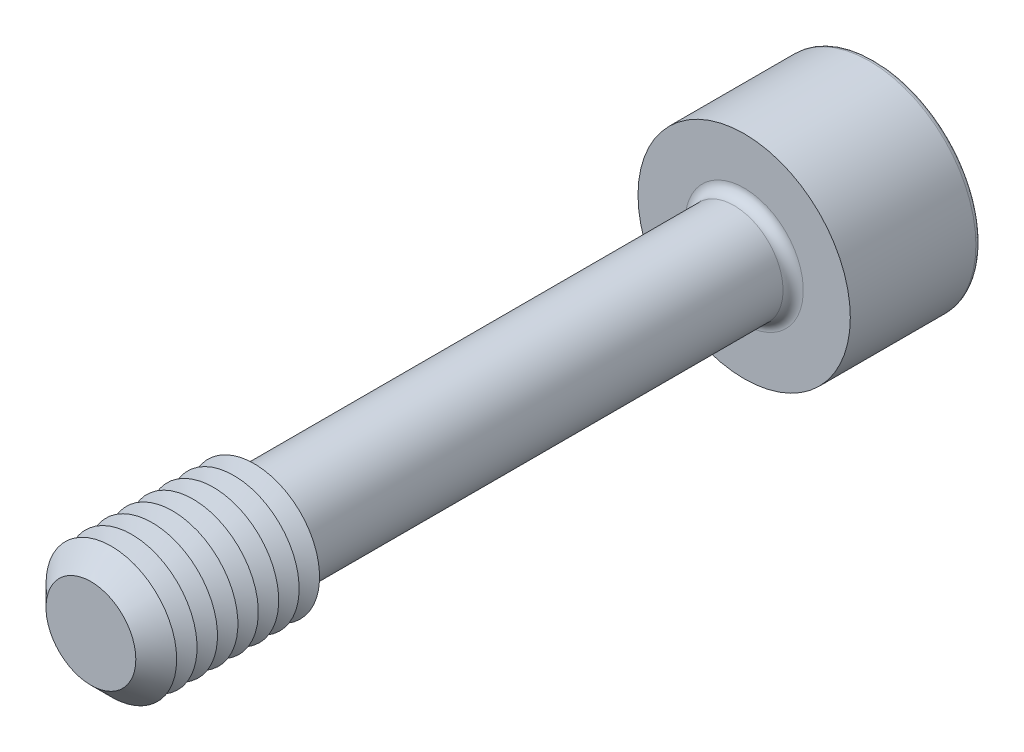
from build123d import *

# Parameters (mm, degrees)
SKETCH1_R       = 3
EXTRUDE1_DEPTH  = 20
CHAMFER1_SIZE   = 1.25
SKETCH3_R       = 6.5
EXTRUDE2_DEPTH  = 8
EXTRUDE3_DEPTH  = 6
FILLET1_R       = 0.62
FILLET2_R       = 0.31
LPATTERN1_COUNT = 7
LPATTERN1_PITCH = 1.25


with BuildPart() as part:
    # Sketch1 → Extrude1 (new, symmetric)
    with BuildSketch(Plane.XY):
        Circle(SKETCH1_R)
    extrude(amount=EXTRUDE1_DEPTH, both=True)

    # Sketch2 → Revolve1 (revolve)
    with BuildSketch(Plane(origin=(0, 0, 0), x_dir=(0, 0, -1), z_dir=(1, 0, 0))):
        Polygon((-20, 0), (-20, 4), (-10, 4), (-9.422649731, 3), (-9.422649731, 0), align=None)
    revolve(axis=Axis((0, 0, 9.422649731), (0, 0, 1)))

    # Chamfer1
    chamfer1_edges = [part.edges().sort_by_distance(p)[0] for p in [
        (0, -4, 20),
    ]]
    chamfer(chamfer1_edges, length=CHAMFER1_SIZE)

    # Sketch3 → Extrude2 (add)
    with BuildSketch(Plane(origin=(0, 0, -20), x_dir=(-1, 0, 0), z_dir=(0, 0, -1))):
        Circle(SKETCH3_R)
    extrude(amount=EXTRUDE2_DEPTH)

    # Sketch4 → Extrude3 (cut)
    with BuildSketch(Plane(origin=(-13.7, 0, -28), x_dir=(1, 0, 0), z_dir=(0, 0, 1))):
        Polygon((11.967949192, -3), (15.432050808, -3), (17.164101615, 0), (15.432050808, 3), (11.967949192, 3), (10.235898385, 0), align=None)
    extrude(amount=EXTRUDE3_DEPTH, mode=Mode.SUBTRACT)

    # Fillet1
    fillet1_edges = [part.edges().sort_by_distance(p)[0] for p in [
        (-3, 0, -20),
    ]]
    fillet(fillet1_edges, radius=FILLET1_R)

    # Fillet2
    fillet2_edges = [part.edges().sort_by_distance(p)[0] for p in [
        (6.5, 0, -28),
    ]]
    fillet(fillet2_edges, radius=FILLET2_R)

    # Sketch5 → Cut-Revolve1 (revolve, cut)
    with BuildSketch(Plane(origin=(0, 0, 0), x_dir=(0, 0, -1), z_dir=(1, 0, 0)), mode=Mode.PRIVATE) as cut_revolve1_sk:
        Polygon((22, 0), (22, -3), (20.267949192, 0), align=None)
    revolve(cut_revolve1_sk.sketch.rotate(Axis((0, 0, -20.267949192), (0, 0, -1)), 90), axis=Axis((0, 0, -20.267949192), (0, 0, -1)), mode=Mode.SUBTRACT)

    # Sketch7 → Cut-Revolve2 (revolve, cut)
    with BuildSketch(Plane(origin=(0, 0, 0), x_dir=(0, 0, -1), z_dir=(1, 0, 0)), mode=Mode.PRIVATE) as cut_revolve2_sk:
        Polygon((-10, 4), (-10.625, 2.917468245), (-11.25, 4), align=None)
    cut_revolve2 = revolve(cut_revolve2_sk.sketch.rotate(Axis((0, 0, -1.332048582), (0, 0, 1)), 90), axis=Axis((0, 0, -1.332048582), (0, 0, 1)), mode=Mode.SUBTRACT)

    # LPattern1: Cut-Revolve2 ×7
    with Locations(*[(0, 0, i * LPATTERN1_PITCH) for i in range(1, LPATTERN1_COUNT)]):
        add(cut_revolve2, mode=Mode.SUBTRACT)


solid = part.part
